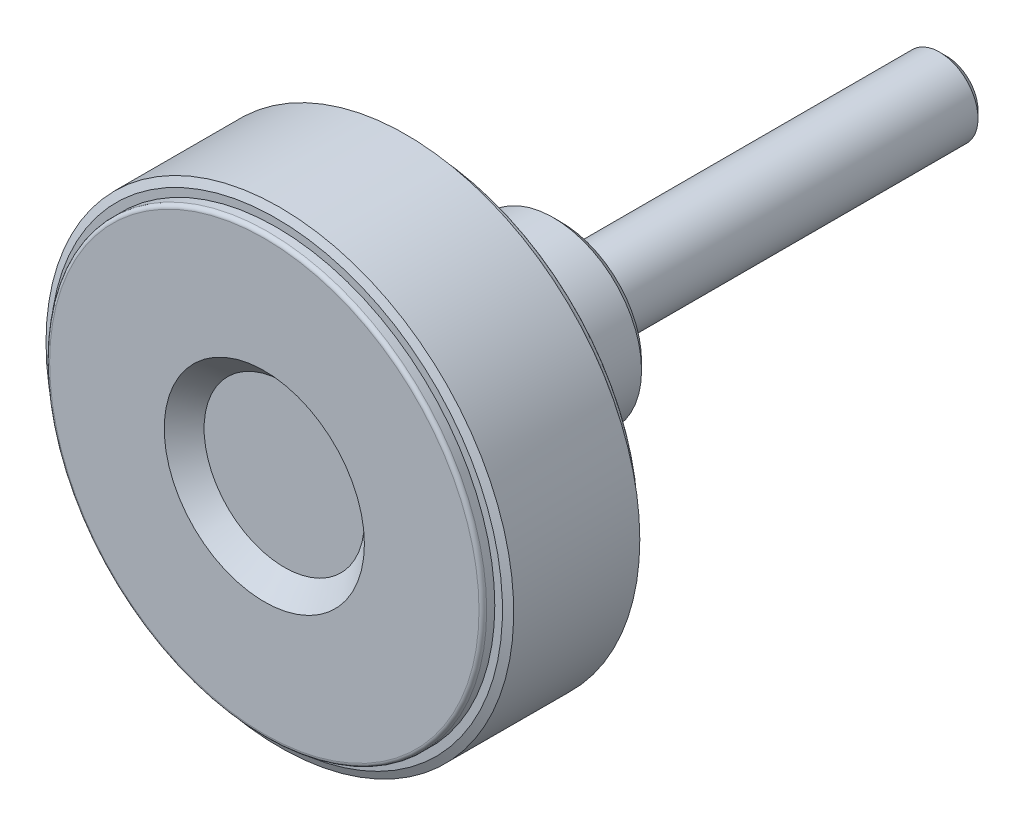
ISO-10303-21;
HEADER;
FILE_DESCRIPTION(('STEP AP214'),'2;1');
FILE_NAME('part.step','',(''),(''),'','','');
FILE_SCHEMA(('AUTOMOTIVE_DESIGN { 1 0 10303 214 1 1 1 1 }'));
ENDSEC;
DATA;
#1=APPLICATION_CONTEXT('core data for automotive mechanical design processes');
#2=APPLICATION_PROTOCOL_DEFINITION('international standard','automotive_design',2000,#1);
#3=PRODUCT_CONTEXT('',#1,'mechanical');
#4=PRODUCT('Part','Part','',(#3));
#5=PRODUCT_RELATED_PRODUCT_CATEGORY('part','',(#4));
#6=PRODUCT_DEFINITION_FORMATION('','',#4);
#7=PRODUCT_DEFINITION_CONTEXT('part definition',#1,'design');
#8=PRODUCT_DEFINITION('design','',#6,#7);
#9=PRODUCT_DEFINITION_SHAPE('','',#8);
#10=(LENGTH_UNIT() NAMED_UNIT(*) SI_UNIT(.MILLI.,.METRE.));
#11=(NAMED_UNIT(*) PLANE_ANGLE_UNIT() SI_UNIT($,.RADIAN.));
#12=(NAMED_UNIT(*) SI_UNIT($,.STERADIAN.) SOLID_ANGLE_UNIT());
#13=UNCERTAINTY_MEASURE_WITH_UNIT(LENGTH_MEASURE(1.E-05),#10,'distance_accuracy_value','');
#14=(GEOMETRIC_REPRESENTATION_CONTEXT(3) GLOBAL_UNCERTAINTY_ASSIGNED_CONTEXT((#13)) GLOBAL_UNIT_ASSIGNED_CONTEXT((#10,
#11,#12)) REPRESENTATION_CONTEXT('',''));
#15=CARTESIAN_POINT('',(0.,0.,0.));
#16=DIRECTION('',(0.,0.,1.));
#17=DIRECTION('',(1.,0.,0.));
#18=AXIS2_PLACEMENT_3D('',#15,#16,#17);
#19=CARTESIAN_POINT('',(0.,2.04,-50.));
#20=DIRECTION('',(0.,0.,-1.));
#21=DIRECTION('',(-1.,0.,0.));
#22=AXIS2_PLACEMENT_3D('',#19,#20,#21);
#23=PLANE('',#22);
#24=CARTESIAN_POINT('',(0.,0.,-50.0000000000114));
#25=DIRECTION('',(0.,0.,1.));
#26=DIRECTION('',(1.,0.,0.));
#27=AXIS2_PLACEMENT_3D('',#24,#25,#26);
#28=CIRCLE('',#27,4.0800000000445);
#29=CARTESIAN_POINT('',(4.08000000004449,0.,-50.0000000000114));
#30=VERTEX_POINT('',#29);
#31=EDGE_CURVE('E179',#30,#30,#28,.T.);
#32=ORIENTED_EDGE('',*,*,#31,.F.);
#33=EDGE_LOOP('',(#32));
#34=FACE_BOUND('',#33,.T.);
#35=ADVANCED_FACE('F14',(#34),#23,.T.);
#36=CARTESIAN_POINT('',(0.,0.,-49.0800000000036));
#37=DIRECTION('',(0.,0.,1.));
#38=DIRECTION('',(1.,0.,0.));
#39=AXIS2_PLACEMENT_3D('',#36,#37,#38);
#40=CONICAL_SURFACE('',#39,5.0000000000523,0.785398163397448);
#41=ORIENTED_EDGE('',*,*,#31,.T.);
#42=EDGE_LOOP('',(#41));
#43=FACE_BOUND('',#42,.T.);
#44=CARTESIAN_POINT('',(0.,0.,-49.08));
#45=DIRECTION('',(0.,0.,1.));
#46=DIRECTION('',(1.,0.,0.));
#47=AXIS2_PLACEMENT_3D('',#44,#45,#46);
#48=CIRCLE('',#47,5.);
#49=CARTESIAN_POINT('',(5.,0.,-49.08));
#50=VERTEX_POINT('',#49);
#51=EDGE_CURVE('E176',#50,#50,#48,.T.);
#52=ORIENTED_EDGE('',*,*,#51,.F.);
#53=EDGE_LOOP('',(#52));
#54=FACE_BOUND('',#53,.T.);
#55=ADVANCED_FACE('F536',(#43,#54),#40,.T.);
#56=CARTESIAN_POINT('',(0.,0.,-24.04));
#57=DIRECTION('',(0.,0.,1.));
#58=DIRECTION('',(1.,0.,0.));
#59=AXIS2_PLACEMENT_3D('',#56,#57,#58);
#60=CYLINDRICAL_SURFACE('',#59,5.);
#61=ORIENTED_EDGE('',*,*,#51,.T.);
#62=EDGE_LOOP('',(#61));
#63=FACE_BOUND('',#62,.T.);
#64=CARTESIAN_POINT('',(0.,0.,0.));
#65=DIRECTION('',(0.,0.,1.));
#66=DIRECTION('',(1.,0.,0.));
#67=AXIS2_PLACEMENT_3D('',#64,#65,#66);
#68=CIRCLE('',#67,5.);
#69=CARTESIAN_POINT('',(5.,0.,0.));
#70=VERTEX_POINT('',#69);
#71=EDGE_CURVE('E178',#70,#70,#68,.T.);
#72=ORIENTED_EDGE('',*,*,#71,.F.);
#73=EDGE_LOOP('',(#72));
#74=FACE_BOUND('',#73,.T.);
#75=ADVANCED_FACE('F526',(#63,#74),#60,.T.);
#76=CARTESIAN_POINT('',(0.,3.33333333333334,0.));
#77=DIRECTION('',(0.,0.,-1.));
#78=DIRECTION('',(-1.,0.,0.));
#79=AXIS2_PLACEMENT_3D('',#76,#77,#78);
#80=PLANE('',#79);
#81=CARTESIAN_POINT('',(0.,0.,0.));
#82=DIRECTION('',(0.,0.,1.));
#83=DIRECTION('',(1.,0.,0.));
#84=AXIS2_PLACEMENT_3D('',#81,#82,#83);
#85=CIRCLE('',#84,6.66666666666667);
#86=CARTESIAN_POINT('',(6.66666666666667,0.,0.));
#87=VERTEX_POINT('',#86);
#88=EDGE_CURVE('E211',#87,#87,#85,.T.);
#89=ORIENTED_EDGE('',*,*,#88,.F.);
#90=EDGE_LOOP('',(#89));
#91=FACE_BOUND('',#90,.T.);
#92=ORIENTED_EDGE('',*,*,#71,.T.);
#93=EDGE_LOOP('',(#92));
#94=FACE_BOUND('',#93,.T.);
#95=ADVANCED_FACE('F516',(#91,#94),#80,.T.);
#96=CARTESIAN_POINT('',(0.,0.,0.15));
#97=DIRECTION('',(0.,0.,1.));
#98=DIRECTION('',(1.,0.,0.));
#99=AXIS2_PLACEMENT_3D('',#96,#97,#98);
#100=CYLINDRICAL_SURFACE('',#99,6.66666666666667);
#101=ORIENTED_EDGE('',*,*,#88,.T.);
#102=EDGE_LOOP('',(#101));
#103=FACE_BOUND('',#102,.T.);
#104=CARTESIAN_POINT('',(0.,0.,0.3));
#105=DIRECTION('',(0.,0.,1.));
#106=DIRECTION('',(1.,0.,0.));
#107=AXIS2_PLACEMENT_3D('',#104,#105,#106);
#108=CIRCLE('',#107,6.66666666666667);
#109=CARTESIAN_POINT('',(6.66666666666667,0.,0.3));
#110=VERTEX_POINT('',#109);
#111=EDGE_CURVE('E208',#110,#110,#108,.T.);
#112=ORIENTED_EDGE('',*,*,#111,.F.);
#113=EDGE_LOOP('',(#112));
#114=FACE_BOUND('',#113,.T.);
#115=ADVANCED_FACE('F506',(#103,#114),#100,.T.);
#116=CARTESIAN_POINT('',(0.,8.58333333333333,0.3));
#117=DIRECTION('',(0.,0.,-1.));
#118=DIRECTION('',(-1.,0.,0.));
#119=AXIS2_PLACEMENT_3D('',#116,#117,#118);
#120=PLANE('',#119);
#121=CARTESIAN_POINT('',(0.,0.,0.3));
#122=DIRECTION('',(0.,0.,1.));
#123=DIRECTION('',(1.,0.,0.));
#124=AXIS2_PLACEMENT_3D('',#121,#122,#123);
#125=CIRCLE('',#124,10.5);
#126=CARTESIAN_POINT('',(10.5,0.,0.3));
#127=VERTEX_POINT('',#126);
#128=EDGE_CURVE('E175',#127,#127,#125,.T.);
#129=ORIENTED_EDGE('',*,*,#128,.F.);
#130=EDGE_LOOP('',(#129));
#131=FACE_BOUND('',#130,.T.);
#132=ORIENTED_EDGE('',*,*,#111,.T.);
#133=EDGE_LOOP('',(#132));
#134=FACE_BOUND('',#133,.T.);
#135=ADVANCED_FACE('F496',(#131,#134),#120,.T.);
#136=CARTESIAN_POINT('',(0.,0.,1.3));
#137=DIRECTION('',(0.,0.,1.));
#138=DIRECTION('',(1.,0.,0.));
#139=AXIS2_PLACEMENT_3D('',#136,#137,#138);
#140=CONICAL_SURFACE('',#139,11.5,0.785398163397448);
#141=ORIENTED_EDGE('',*,*,#128,.T.);
#142=EDGE_LOOP('',(#141));
#143=FACE_BOUND('',#142,.T.);
#144=CARTESIAN_POINT('',(0.,0.,1.3));
#145=DIRECTION('',(0.,0.,1.));
#146=DIRECTION('',(1.,0.,0.));
#147=AXIS2_PLACEMENT_3D('',#144,#145,#146);
#148=CIRCLE('',#147,11.5);
#149=CARTESIAN_POINT('',(11.5,0.,1.3));
#150=VERTEX_POINT('',#149);
#151=EDGE_CURVE('E172',#150,#150,#148,.T.);
#152=ORIENTED_EDGE('',*,*,#151,.F.);
#153=EDGE_LOOP('',(#152));
#154=FACE_BOUND('',#153,.T.);
#155=ADVANCED_FACE('F487',(#143,#154),#140,.T.);
#156=CARTESIAN_POINT('',(0.,0.,16.4));
#157=DIRECTION('',(0.,0.,1.));
#158=DIRECTION('',(1.,0.,0.));
#159=AXIS2_PLACEMENT_3D('',#156,#157,#158);
#160=CYLINDRICAL_SURFACE('',#159,11.5);
#161=ORIENTED_EDGE('',*,*,#151,.T.);
#162=EDGE_LOOP('',(#161));
#163=FACE_BOUND('',#162,.T.);
#164=CARTESIAN_POINT('',(0.,0.,31.5));
#165=DIRECTION('',(0.,0.,-1.));
#166=DIRECTION('',(-1.,0.,0.));
#167=AXIS2_PLACEMENT_3D('',#164,#165,#166);
#168=CIRCLE('',#167,11.5);
#169=CARTESIAN_POINT('',(-11.5,0.,31.5));
#170=VERTEX_POINT('',#169);
#171=EDGE_CURVE('E75',#170,#170,#168,.T.);
#172=ORIENTED_EDGE('',*,*,#171,.T.);
#173=EDGE_LOOP('',(#172));
#174=FACE_BOUND('',#173,.T.);
#175=ADVANCED_FACE('F482',(#163,#174),#160,.T.);
#176=CARTESIAN_POINT('',(0.,0.,31.5));
#177=DIRECTION('',(0.,0.,-1.));
#178=DIRECTION('',(-1.,0.,0.));
#179=AXIS2_PLACEMENT_3D('',#176,#177,#178);
#180=TOROIDAL_SURFACE('',#179,12.5,1.);
#181=CARTESIAN_POINT('',(0.,0.,32.5));
#182=DIRECTION('',(0.,0.,-1.));
#183=DIRECTION('',(1.,0.,0.));
#184=AXIS2_PLACEMENT_3D('',#181,#182,#183);
#185=CIRCLE('',#184,12.5);
#186=CARTESIAN_POINT('',(-12.5,0.,32.5));
#187=VERTEX_POINT('',#186);
#188=CARTESIAN_POINT('',(12.5,0.,32.5));
#189=VERTEX_POINT('',#188);
#190=EDGE_CURVE('E68',#187,#189,#185,.F.);
#191=ORIENTED_EDGE('',*,*,#190,.F.);
#192=CARTESIAN_POINT('',(0.,0.,32.5));
#193=DIRECTION('',(0.,0.,-1.));
#194=DIRECTION('',(-1.,0.,0.));
#195=AXIS2_PLACEMENT_3D('',#192,#193,#194);
#196=CIRCLE('',#195,12.5);
#197=CARTESIAN_POINT('',(0.,12.5,32.5));
#198=VERTEX_POINT('',#197);
#199=EDGE_CURVE('E71',#198,#187,#196,.F.);
#200=ORIENTED_EDGE('',*,*,#199,.F.);
#201=CARTESIAN_POINT('',(0.,0.,32.5));
#202=DIRECTION('',(0.,0.,-1.));
#203=DIRECTION('',(0.,1.,0.));
#204=AXIS2_PLACEMENT_3D('',#201,#202,#203);
#205=CIRCLE('',#204,12.5);
#206=EDGE_CURVE('E63',#189,#198,#205,.F.);
#207=ORIENTED_EDGE('',*,*,#206,.F.);
#208=EDGE_LOOP('',(#191,#200,#207));
#209=FACE_BOUND('',#208,.T.);
#210=ORIENTED_EDGE('',*,*,#171,.F.);
#211=EDGE_LOOP('',(#210));
#212=FACE_BOUND('',#211,.T.);
#213=ADVANCED_FACE('F66',(#209,#212),#180,.F.);
#214=CARTESIAN_POINT('',(0.,17.4807692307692,32.5));
#215=DIRECTION('',(0.,0.,-1.));
#216=DIRECTION('',(-1.,0.,0.));
#217=AXIS2_PLACEMENT_3D('',#214,#215,#216);
#218=PLANE('',#217);
#219=CARTESIAN_POINT('',(0.,0.,32.5));
#220=DIRECTION('',(0.,0.,1.));
#221=DIRECTION('',(-1.,0.,0.));
#222=AXIS2_PLACEMENT_3D('',#219,#220,#221);
#223=CIRCLE('',#222,22.4615384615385);
#224=CARTESIAN_POINT('',(22.4615384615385,0.,32.5));
#225=VERTEX_POINT('',#224);
#226=CARTESIAN_POINT('',(-22.4615384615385,0.,32.5));
#227=VERTEX_POINT('',#226);
#228=EDGE_CURVE('E81',#225,#227,#223,.F.);
#229=ORIENTED_EDGE('',*,*,#228,.T.);
#230=CARTESIAN_POINT('',(0.,0.,32.5));
#231=DIRECTION('',(0.,0.,1.));
#232=DIRECTION('',(0.,1.,0.));
#233=AXIS2_PLACEMENT_3D('',#230,#231,#232);
#234=CIRCLE('',#233,22.4615384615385);
#235=CARTESIAN_POINT('',(0.,22.4615384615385,32.5));
#236=VERTEX_POINT('',#235);
#237=EDGE_CURVE('E130',#227,#236,#234,.F.);
#238=ORIENTED_EDGE('',*,*,#237,.T.);
#239=CARTESIAN_POINT('',(0.,0.,32.5));
#240=DIRECTION('',(0.,0.,1.));
#241=DIRECTION('',(1.,0.,0.));
#242=AXIS2_PLACEMENT_3D('',#239,#240,#241);
#243=CIRCLE('',#242,22.4615384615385);
#244=EDGE_CURVE('E143',#236,#225,#243,.F.);
#245=ORIENTED_EDGE('',*,*,#244,.T.);
#246=EDGE_LOOP('',(#229,#238,#245));
#247=FACE_BOUND('',#246,.T.);
#248=ORIENTED_EDGE('',*,*,#199,.T.);
#249=ORIENTED_EDGE('',*,*,#190,.T.);
#250=ORIENTED_EDGE('',*,*,#206,.T.);
#251=EDGE_LOOP('',(#248,#249,#250));
#252=FACE_BOUND('',#251,.T.);
#253=ADVANCED_FACE('F79',(#247,#252),#218,.T.);
#254=CARTESIAN_POINT('',(0.,0.,31.5));
#255=DIRECTION('',(0.,0.,-1.));
#256=DIRECTION('',(-1.,0.,0.));
#257=AXIS2_PLACEMENT_3D('',#254,#255,#256);
#258=TOROIDAL_SURFACE('',#257,22.4615384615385,1.);
#259=ORIENTED_EDGE('',*,*,#237,.F.);
#260=ORIENTED_EDGE('',*,*,#228,.F.);
#261=ORIENTED_EDGE('',*,*,#244,.F.);
#262=EDGE_LOOP('',(#259,#260,#261));
#263=FACE_BOUND('',#262,.T.);
#264=CARTESIAN_POINT('',(0.,0.,31.5));
#265=DIRECTION('',(0.,0.,1.));
#266=DIRECTION('',(1.,0.,0.));
#267=AXIS2_PLACEMENT_3D('',#264,#265,#266);
#268=CIRCLE('',#267,23.4615384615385);
#269=CARTESIAN_POINT('',(23.4615384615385,0.,31.5));
#270=VERTEX_POINT('',#269);
#271=EDGE_CURVE('E205',#270,#270,#268,.F.);
#272=ORIENTED_EDGE('',*,*,#271,.T.);
#273=EDGE_LOOP('',(#272));
#274=FACE_BOUND('',#273,.T.);
#275=ADVANCED_FACE('F100',(#263,#274),#258,.F.);
#276=CARTESIAN_POINT('',(0.,0.,25.));
#277=DIRECTION('',(0.,0.,1.));
#278=DIRECTION('',(1.,0.,0.));
#279=AXIS2_PLACEMENT_3D('',#276,#277,#278);
#280=CYLINDRICAL_SURFACE('',#279,23.4615384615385);
#281=ORIENTED_EDGE('',*,*,#271,.F.);
#282=EDGE_LOOP('',(#281));
#283=FACE_BOUND('',#282,.T.);
#284=CARTESIAN_POINT('',(0.,0.,18.5));
#285=DIRECTION('',(0.,0.,1.));
#286=DIRECTION('',(1.,0.,0.));
#287=AXIS2_PLACEMENT_3D('',#284,#285,#286);
#288=CIRCLE('',#287,23.4615384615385);
#289=CARTESIAN_POINT('',(23.4615384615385,0.,18.5));
#290=VERTEX_POINT('',#289);
#291=EDGE_CURVE('E201',#290,#290,#288,.T.);
#292=ORIENTED_EDGE('',*,*,#291,.F.);
#293=EDGE_LOOP('',(#292));
#294=FACE_BOUND('',#293,.T.);
#295=ADVANCED_FACE('F329',(#283,#294),#280,.F.);
#296=CARTESIAN_POINT('',(0.,25.7307692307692,18.5));
#297=DIRECTION('',(0.,0.,-1.));
#298=DIRECTION('',(-1.,0.,0.));
#299=AXIS2_PLACEMENT_3D('',#296,#297,#298);
#300=PLANE('',#299);
#301=CARTESIAN_POINT('',(0.,0.,18.5));
#302=DIRECTION('',(0.,0.,1.));
#303=DIRECTION('',(-1.,0.,0.));
#304=AXIS2_PLACEMENT_3D('',#301,#302,#303);
#305=CIRCLE('',#304,28.);
#306=CARTESIAN_POINT('',(-28.,0.,18.5));
#307=VERTEX_POINT('',#306);
#308=CARTESIAN_POINT('',(28.,0.,18.5));
#309=VERTEX_POINT('',#308);
#310=EDGE_CURVE('E264',#307,#309,#305,.T.);
#311=ORIENTED_EDGE('',*,*,#310,.F.);
#312=CARTESIAN_POINT('',(0.,0.,18.5));
#313=DIRECTION('',(0.,0.,1.));
#314=DIRECTION('',(0.,1.,0.));
#315=AXIS2_PLACEMENT_3D('',#312,#313,#314);
#316=CIRCLE('',#315,28.);
#317=CARTESIAN_POINT('',(0.,28.,18.5));
#318=VERTEX_POINT('',#317);
#319=EDGE_CURVE('E299',#318,#307,#316,.T.);
#320=ORIENTED_EDGE('',*,*,#319,.F.);
#321=CARTESIAN_POINT('',(0.,0.,18.5));
#322=DIRECTION('',(0.,0.,1.));
#323=DIRECTION('',(1.,0.,0.));
#324=AXIS2_PLACEMENT_3D('',#321,#322,#323);
#325=CIRCLE('',#324,28.);
#326=EDGE_CURVE('E204',#309,#318,#325,.T.);
#327=ORIENTED_EDGE('',*,*,#326,.F.);
#328=EDGE_LOOP('',(#311,#320,#327));
#329=FACE_BOUND('',#328,.T.);
#330=ORIENTED_EDGE('',*,*,#291,.T.);
#331=EDGE_LOOP('',(#330));
#332=FACE_BOUND('',#331,.T.);
#333=ADVANCED_FACE('F275',(#329,#332),#300,.T.);
#334=CARTESIAN_POINT('',(0.,0.,19.));
#335=DIRECTION('',(0.,0.,-1.));
#336=DIRECTION('',(-1.,0.,0.));
#337=AXIS2_PLACEMENT_3D('',#334,#335,#336);
#338=TOROIDAL_SURFACE('',#337,28.,0.5);
#339=ORIENTED_EDGE('',*,*,#319,.T.);
#340=ORIENTED_EDGE('',*,*,#310,.T.);
#341=ORIENTED_EDGE('',*,*,#326,.T.);
#342=EDGE_LOOP('',(#339,#340,#341));
#343=FACE_BOUND('',#342,.T.);
#344=CARTESIAN_POINT('',(0.,0.,19.));
#345=DIRECTION('',(0.,0.,1.));
#346=DIRECTION('',(1.,0.,0.));
#347=AXIS2_PLACEMENT_3D('',#344,#345,#346);
#348=CIRCLE('',#347,28.5);
#349=CARTESIAN_POINT('',(28.5,0.,19.));
#350=VERTEX_POINT('',#349);
#351=EDGE_CURVE('E200',#350,#350,#348,.T.);
#352=ORIENTED_EDGE('',*,*,#351,.F.);
#353=EDGE_LOOP('',(#352));
#354=FACE_BOUND('',#353,.T.);
#355=ADVANCED_FACE('F269',(#343,#354),#338,.T.);
#356=CARTESIAN_POINT('',(0.,0.,19.53));
#357=DIRECTION('',(0.,0.,1.));
#358=DIRECTION('',(1.,0.,0.));
#359=AXIS2_PLACEMENT_3D('',#356,#357,#358);
#360=CYLINDRICAL_SURFACE('',#359,28.5);
#361=ORIENTED_EDGE('',*,*,#351,.T.);
#362=EDGE_LOOP('',(#361));
#363=FACE_BOUND('',#362,.T.);
#364=CARTESIAN_POINT('',(0.,0.,20.06));
#365=DIRECTION('',(0.,0.,1.));
#366=DIRECTION('',(1.,0.,0.));
#367=AXIS2_PLACEMENT_3D('',#364,#365,#366);
#368=CIRCLE('',#367,28.5);
#369=CARTESIAN_POINT('',(28.5,0.,20.06));
#370=VERTEX_POINT('',#369);
#371=EDGE_CURVE('E197',#370,#370,#368,.T.);
#372=ORIENTED_EDGE('',*,*,#371,.F.);
#373=EDGE_LOOP('',(#372));
#374=FACE_BOUND('',#373,.T.);
#375=ADVANCED_FACE('F274',(#363,#374),#360,.T.);
#376=CARTESIAN_POINT('',(0.,29.,20.06));
#377=DIRECTION('',(0.,0.,-1.));
#378=DIRECTION('',(-1.,0.,0.));
#379=AXIS2_PLACEMENT_3D('',#376,#377,#378);
#380=PLANE('',#379);
#381=CARTESIAN_POINT('',(0.,0.,20.06));
#382=DIRECTION('',(0.,0.,1.));
#383=DIRECTION('',(1.,0.,0.));
#384=AXIS2_PLACEMENT_3D('',#381,#382,#383);
#385=CIRCLE('',#384,29.5);
#386=CARTESIAN_POINT('',(29.5,0.,20.06));
#387=VERTEX_POINT('',#386);
#388=EDGE_CURVE('E193',#387,#387,#385,.T.);
#389=ORIENTED_EDGE('',*,*,#388,.F.);
#390=EDGE_LOOP('',(#389));
#391=FACE_BOUND('',#390,.T.);
#392=ORIENTED_EDGE('',*,*,#371,.T.);
#393=EDGE_LOOP('',(#392));
#394=FACE_BOUND('',#393,.T.);
#395=ADVANCED_FACE('F342',(#391,#394),#380,.T.);
#396=CARTESIAN_POINT('',(0.,0.,20.526307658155));
#397=DIRECTION('',(0.,0.,1.));
#398=DIRECTION('',(1.,0.,0.));
#399=AXIS2_PLACEMENT_3D('',#396,#397,#398);
#400=CONICAL_SURFACE('',#399,30.5,1.13446401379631);
#401=CARTESIAN_POINT('',(-1.81188397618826E-13,-3.78364006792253E-12,20.526307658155));
#402=DIRECTION('',(0.,0.,-1.));
#403=DIRECTION('',(-1.,0.,0.));
#404=AXIS2_PLACEMENT_3D('',#401,#402,#403);
#405=CIRCLE('',#404,30.5000000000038);
#406=CARTESIAN_POINT('',(-30.500000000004,-3.78364006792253E-12,20.526307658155));
#407=VERTEX_POINT('',#406);
#408=EDGE_CURVE('E196',#407,#407,#405,.F.);
#409=ORIENTED_EDGE('',*,*,#408,.F.);
#410=EDGE_LOOP('',(#409));
#411=FACE_BOUND('',#410,.T.);
#412=ORIENTED_EDGE('',*,*,#388,.T.);
#413=EDGE_LOOP('',(#412));
#414=FACE_BOUND('',#413,.T.);
#415=ADVANCED_FACE('F340',(#411,#414),#400,.T.);
#416=CARTESIAN_POINT('',(0.,5.22727272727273,36.4));
#417=DIRECTION('',(0.,0.,1.));
#418=DIRECTION('',(1.,0.,0.));
#419=AXIS2_PLACEMENT_3D('',#416,#417,#418);
#420=PLANE('',#419);
#421=CARTESIAN_POINT('',(0.,0.,36.4));
#422=DIRECTION('',(0.,0.,1.));
#423=DIRECTION('',(1.,0.,0.));
#424=AXIS2_PLACEMENT_3D('',#421,#422,#423);
#425=CIRCLE('',#424,10.4545454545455);
#426=CARTESIAN_POINT('',(10.4545454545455,0.,36.4));
#427=VERTEX_POINT('',#426);
#428=EDGE_CURVE('E181',#427,#427,#425,.T.);
#429=ORIENTED_EDGE('',*,*,#428,.T.);
#430=EDGE_LOOP('',(#429));
#431=FACE_BOUND('',#430,.T.);
#432=ADVANCED_FACE('F242',(#431),#420,.T.);
#433=CARTESIAN_POINT('',(0.,0.,39.));
#434=DIRECTION('',(0.,0.,1.));
#435=DIRECTION('',(1.,0.,0.));
#436=AXIS2_PLACEMENT_3D('',#433,#434,#435);
#437=CONICAL_SURFACE('',#436,13.0545454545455,0.785398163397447);
#438=CARTESIAN_POINT('',(0.,0.,39.));
#439=DIRECTION('',(0.,0.,1.));
#440=DIRECTION('',(1.,0.,0.));
#441=AXIS2_PLACEMENT_3D('',#438,#439,#440);
#442=CIRCLE('',#441,13.0545454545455);
#443=CARTESIAN_POINT('',(13.0545454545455,0.,39.));
#444=VERTEX_POINT('',#443);
#445=EDGE_CURVE('E9',#444,#444,#442,.F.);
#446=ORIENTED_EDGE('',*,*,#445,.F.);
#447=EDGE_LOOP('',(#446));
#448=FACE_BOUND('',#447,.T.);
#449=ORIENTED_EDGE('',*,*,#428,.F.);
#450=EDGE_LOOP('',(#449));
#451=FACE_BOUND('',#450,.T.);
#452=ADVANCED_FACE('F240',(#448,#451),#437,.F.);
#453=CARTESIAN_POINT('',(0.,20.5272727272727,39.));
#454=DIRECTION('',(0.,0.,1.));
#455=DIRECTION('',(1.,0.,0.));
#456=AXIS2_PLACEMENT_3D('',#453,#454,#455);
#457=PLANE('',#456);
#458=ORIENTED_EDGE('',*,*,#445,.T.);
#459=EDGE_LOOP('',(#458));
#460=FACE_BOUND('',#459,.T.);
#461=CARTESIAN_POINT('',(0.,0.,39.));
#462=DIRECTION('',(0.,0.,-1.));
#463=DIRECTION('',(-1.,0.,0.));
#464=AXIS2_PLACEMENT_3D('',#461,#462,#463);
#465=CIRCLE('',#464,28.);
#466=CARTESIAN_POINT('',(0.,28.,39.));
#467=VERTEX_POINT('',#466);
#468=CARTESIAN_POINT('',(-28.,0.,39.));
#469=VERTEX_POINT('',#468);
#470=EDGE_CURVE('E219',#467,#469,#465,.F.);
#471=ORIENTED_EDGE('',*,*,#470,.T.);
#472=CARTESIAN_POINT('',(0.,0.,39.));
#473=DIRECTION('',(0.,0.,-1.));
#474=DIRECTION('',(1.,0.,0.));
#475=AXIS2_PLACEMENT_3D('',#472,#473,#474);
#476=CIRCLE('',#475,28.);
#477=CARTESIAN_POINT('',(28.,0.,39.));
#478=VERTEX_POINT('',#477);
#479=EDGE_CURVE('E23',#469,#478,#476,.F.);
#480=ORIENTED_EDGE('',*,*,#479,.T.);
#481=CARTESIAN_POINT('',(0.,0.,39.));
#482=DIRECTION('',(0.,0.,-1.));
#483=DIRECTION('',(0.,1.,0.));
#484=AXIS2_PLACEMENT_3D('',#481,#482,#483);
#485=CIRCLE('',#484,28.);
#486=EDGE_CURVE('E184',#478,#467,#485,.F.);
#487=ORIENTED_EDGE('',*,*,#486,.T.);
#488=EDGE_LOOP('',(#471,#480,#487));
#489=FACE_BOUND('',#488,.T.);
#490=ADVANCED_FACE('F238',(#460,#489),#457,.T.);
#491=CARTESIAN_POINT('',(0.,0.,38.5));
#492=DIRECTION('',(0.,0.,-1.));
#493=DIRECTION('',(-1.,0.,0.));
#494=AXIS2_PLACEMENT_3D('',#491,#492,#493);
#495=TOROIDAL_SURFACE('',#494,28.,0.5);
#496=CARTESIAN_POINT('',(0.,0.,38.5));
#497=DIRECTION('',(0.,0.,-1.));
#498=DIRECTION('',(-1.,0.,0.));
#499=AXIS2_PLACEMENT_3D('',#496,#497,#498);
#500=CIRCLE('',#499,28.5);
#501=CARTESIAN_POINT('',(-28.5,0.,38.5));
#502=VERTEX_POINT('',#501);
#503=EDGE_CURVE('E185',#502,#502,#500,.F.);
#504=ORIENTED_EDGE('',*,*,#503,.T.);
#505=EDGE_LOOP('',(#504));
#506=FACE_BOUND('',#505,.T.);
#507=ORIENTED_EDGE('',*,*,#479,.F.);
#508=ORIENTED_EDGE('',*,*,#470,.F.);
#509=ORIENTED_EDGE('',*,*,#486,.F.);
#510=EDGE_LOOP('',(#507,#508,#509));
#511=FACE_BOUND('',#510,.T.);
#512=ADVANCED_FACE('F226',(#506,#511),#495,.T.);
#513=CARTESIAN_POINT('',(0.,0.,37.97));
#514=DIRECTION('',(0.,0.,1.));
#515=DIRECTION('',(1.,0.,0.));
#516=AXIS2_PLACEMENT_3D('',#513,#514,#515);
#517=CYLINDRICAL_SURFACE('',#516,28.5);
#518=ORIENTED_EDGE('',*,*,#503,.F.);
#519=EDGE_LOOP('',(#518));
#520=FACE_BOUND('',#519,.T.);
#521=CARTESIAN_POINT('',(0.,0.,37.44));
#522=DIRECTION('',(0.,0.,1.));
#523=DIRECTION('',(1.,0.,0.));
#524=AXIS2_PLACEMENT_3D('',#521,#522,#523);
#525=CIRCLE('',#524,28.5);
#526=CARTESIAN_POINT('',(28.5,0.,37.44));
#527=VERTEX_POINT('',#526);
#528=EDGE_CURVE('E186',#527,#527,#525,.T.);
#529=ORIENTED_EDGE('',*,*,#528,.T.);
#530=EDGE_LOOP('',(#529));
#531=FACE_BOUND('',#530,.T.);
#532=ADVANCED_FACE('F237',(#520,#531),#517,.T.);
#533=CARTESIAN_POINT('',(0.,0.,36.973692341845));
#534=DIRECTION('',(0.,0.,-1.));
#535=DIRECTION('',(-1.,0.,0.));
#536=AXIS2_PLACEMENT_3D('',#533,#534,#535);
#537=CONICAL_SURFACE('',#536,30.5,1.13446401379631);
#538=CARTESIAN_POINT('',(0.,0.,37.44));
#539=DIRECTION('',(0.,0.,-1.));
#540=DIRECTION('',(-1.,0.,0.));
#541=AXIS2_PLACEMENT_3D('',#538,#539,#540);
#542=CIRCLE('',#541,29.5);
#543=CARTESIAN_POINT('',(-29.5,0.,37.44));
#544=VERTEX_POINT('',#543);
#545=EDGE_CURVE('E189',#544,#544,#542,.F.);
#546=ORIENTED_EDGE('',*,*,#545,.F.);
#547=EDGE_LOOP('',(#546));
#548=FACE_BOUND('',#547,.T.);
#549=CARTESIAN_POINT('',(0.,0.,36.973692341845));
#550=DIRECTION('',(0.,0.,-1.));
#551=DIRECTION('',(0.,1.,0.));
#552=AXIS2_PLACEMENT_3D('',#549,#550,#551);
#553=CIRCLE('',#552,30.5);
#554=CARTESIAN_POINT('',(0.,30.5,36.973692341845));
#555=VERTEX_POINT('',#554);
#556=EDGE_CURVE('E192',#555,#555,#553,.F.);
#557=ORIENTED_EDGE('',*,*,#556,.T.);
#558=EDGE_LOOP('',(#557));
#559=FACE_BOUND('',#558,.T.);
#560=ADVANCED_FACE('F360',(#548,#559),#537,.T.);
#561=CARTESIAN_POINT('',(0.,29.,37.44));
#562=DIRECTION('',(0.,0.,1.));
#563=DIRECTION('',(1.,0.,0.));
#564=AXIS2_PLACEMENT_3D('',#561,#562,#563);
#565=PLANE('',#564);
#566=ORIENTED_EDGE('',*,*,#528,.F.);
#567=EDGE_LOOP('',(#566));
#568=FACE_BOUND('',#567,.T.);
#569=ORIENTED_EDGE('',*,*,#545,.T.);
#570=EDGE_LOOP('',(#569));
#571=FACE_BOUND('',#570,.T.);
#572=ADVANCED_FACE('F358',(#568,#571),#565,.T.);
#573=CARTESIAN_POINT('',(-1.81188397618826E-13,-3.78364006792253E-12,0.));
#574=DIRECTION('',(0.,0.,-1.));
#575=DIRECTION('',(-1.,0.,0.));
#576=AXIS2_PLACEMENT_3D('',#573,#574,#575);
#577=CYLINDRICAL_SURFACE('',#576,30.5000000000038);
#578=ORIENTED_EDGE('',*,*,#408,.T.);
#579=EDGE_LOOP('',(#578));
#580=FACE_BOUND('',#579,.T.);
#581=ORIENTED_EDGE('',*,*,#556,.F.);
#582=EDGE_LOOP('',(#581));
#583=FACE_BOUND('',#582,.T.);
#584=ADVANCED_FACE('F355',(#580,#583),#577,.T.);
#585=CLOSED_SHELL('',(#35,#55,#75,#95,#115,#135,#155,#175,#213,#253,#275,#295,#333,#355,#375,
#395,#415,#432,#452,#490,#512,#532,#560,#572,#584));
#586=MANIFOLD_SOLID_BREP('B1',#585);
#587=ADVANCED_BREP_SHAPE_REPRESENTATION('',(#18,#586),#14);
#588=SHAPE_DEFINITION_REPRESENTATION(#9,#587);
ENDSEC;
END-ISO-10303-21;
